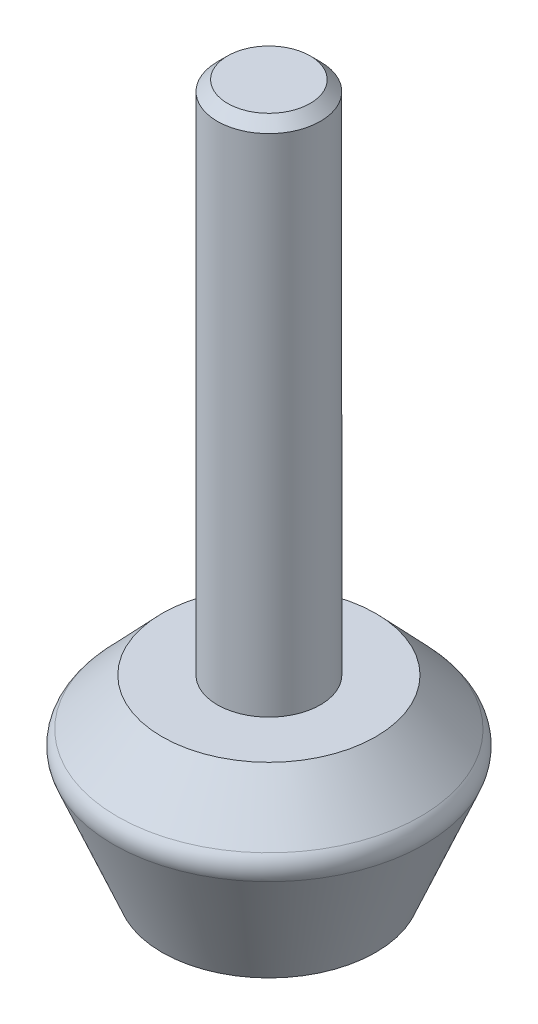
from build123d import *

# Parameters (mm, degrees)
CONG_1_R        = 1
CHANFREIN1_SIZE = 0.5


with BuildPart() as part:
    # Esquisse1 → Base-R_volution (revolve)
    with BuildSketch(Plane.XY, mode=Mode.PRIVATE) as base_r_volution_sk:
        Polygon((0, 0), (5.181217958, 0), (7.791287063, 6.313152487), (5.181217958, 9.055043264), (2.5, 9.055043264), (2.5, 34.055043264), (0, 34.055043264), align=None)
    revolve(base_r_volution_sk.sketch.rotate(Axis((0, 60.93909465, 0), (0, -1, 0)), 90), axis=Axis((0, 60.93909465, 0), (0, -1, 0)))

    # Cong_1
    cong_1_edges = [part.edges().sort_by_distance(p)[0] for p in [
        (0, 6.313152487, -7.791287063),
    ]]
    fillet(cong_1_edges, radius=CONG_1_R)

    # Chanfrein1
    chanfrein1_edges = [part.edges().sort_by_distance(p)[0] for p in [
        (0, 34.055043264, -2.5),
    ]]
    chamfer(chanfrein1_edges, length=CHANFREIN1_SIZE)


solid = part.part
